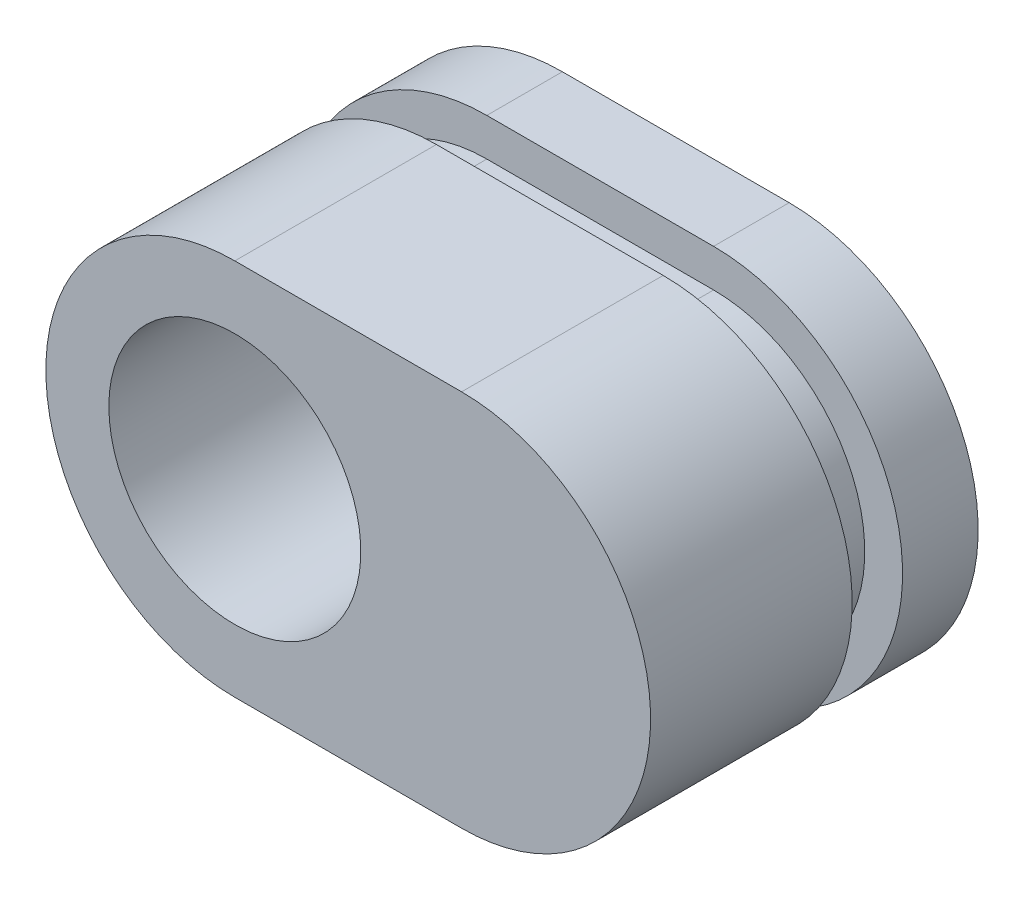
ISO-10303-21;
HEADER;
FILE_DESCRIPTION(('STEP AP214'),'2;1');
FILE_NAME('part.step','',(''),(''),'','','');
FILE_SCHEMA(('AUTOMOTIVE_DESIGN { 1 0 10303 214 1 1 1 1 }'));
ENDSEC;
DATA;
#1=APPLICATION_CONTEXT('core data for automotive mechanical design processes');
#2=APPLICATION_PROTOCOL_DEFINITION('international standard','automotive_design',2000,#1);
#3=PRODUCT_CONTEXT('',#1,'mechanical');
#4=PRODUCT('Part','Part','',(#3));
#5=PRODUCT_RELATED_PRODUCT_CATEGORY('part','',(#4));
#6=PRODUCT_DEFINITION_FORMATION('','',#4);
#7=PRODUCT_DEFINITION_CONTEXT('part definition',#1,'design');
#8=PRODUCT_DEFINITION('design','',#6,#7);
#9=PRODUCT_DEFINITION_SHAPE('','',#8);
#10=(LENGTH_UNIT() NAMED_UNIT(*) SI_UNIT(.MILLI.,.METRE.));
#11=(NAMED_UNIT(*) PLANE_ANGLE_UNIT() SI_UNIT($,.RADIAN.));
#12=(NAMED_UNIT(*) SI_UNIT($,.STERADIAN.) SOLID_ANGLE_UNIT());
#13=UNCERTAINTY_MEASURE_WITH_UNIT(LENGTH_MEASURE(1.E-05),#10,'distance_accuracy_value','');
#14=(GEOMETRIC_REPRESENTATION_CONTEXT(3) GLOBAL_UNCERTAINTY_ASSIGNED_CONTEXT((#13)) GLOBAL_UNIT_ASSIGNED_CONTEXT((#10,
#11,#12)) REPRESENTATION_CONTEXT('',''));
#15=CARTESIAN_POINT('',(0.,0.,0.));
#16=DIRECTION('',(0.,0.,1.));
#17=DIRECTION('',(1.,0.,0.));
#18=AXIS2_PLACEMENT_3D('',#15,#16,#17);
#19=CARTESIAN_POINT('',(4.5,0.,2.));
#20=DIRECTION('',(0.,0.,-1.));
#21=DIRECTION('',(-1.,0.,0.));
#22=AXIS2_PLACEMENT_3D('',#19,#20,#21);
#23=CYLINDRICAL_SURFACE('',#22,6.);
#24=CARTESIAN_POINT('',(4.5,0.,0.));
#25=DIRECTION('',(0.,0.,1.));
#26=DIRECTION('',(1.,0.,0.));
#27=AXIS2_PLACEMENT_3D('',#24,#25,#26);
#28=CIRCLE('',#27,6.);
#29=CARTESIAN_POINT('',(4.5,-6.,0.));
#30=VERTEX_POINT('',#29);
#31=CARTESIAN_POINT('',(4.5,6.,0.));
#32=VERTEX_POINT('',#31);
#33=EDGE_CURVE('E184',#30,#32,#28,.T.);
#34=ORIENTED_EDGE('',*,*,#33,.T.);
#35=DIRECTION('',(0.,0.,-1.));
#36=VECTOR('',#35,1.);
#37=CARTESIAN_POINT('',(4.5,6.,2.));
#38=LINE('',#37,#36);
#39=CARTESIAN_POINT('',(4.5,6.,2.));
#40=VERTEX_POINT('',#39);
#41=EDGE_CURVE('E11',#40,#32,#38,.T.);
#42=ORIENTED_EDGE('',*,*,#41,.F.);
#43=CARTESIAN_POINT('',(4.5,0.,2.));
#44=DIRECTION('',(0.,0.,1.));
#45=DIRECTION('',(1.,0.,0.));
#46=AXIS2_PLACEMENT_3D('',#43,#44,#45);
#47=CIRCLE('',#46,6.);
#48=CARTESIAN_POINT('',(4.5,-6.,2.));
#49=VERTEX_POINT('',#48);
#50=EDGE_CURVE('E185',#49,#40,#47,.T.);
#51=ORIENTED_EDGE('',*,*,#50,.F.);
#52=DIRECTION('',(0.,0.,-1.));
#53=VECTOR('',#52,1.);
#54=CARTESIAN_POINT('',(4.5,-6.,2.));
#55=LINE('',#54,#53);
#56=EDGE_CURVE('E198',#49,#30,#55,.T.);
#57=ORIENTED_EDGE('',*,*,#56,.T.);
#58=EDGE_LOOP('',(#34,#42,#51,#57));
#59=FACE_BOUND('',#58,.T.);
#60=ADVANCED_FACE('F39',(#59),#23,.T.);
#61=CARTESIAN_POINT('',(4.5,6.,2.));
#62=DIRECTION('',(0.,-1.,0.));
#63=DIRECTION('',(1.,0.,0.));
#64=AXIS2_PLACEMENT_3D('',#61,#62,#63);
#65=PLANE('',#64);
#66=DIRECTION('',(-1.,0.,0.));
#67=VECTOR('',#66,1.);
#68=CARTESIAN_POINT('',(4.5,6.,0.));
#69=LINE('',#68,#67);
#70=CARTESIAN_POINT('',(-4.5,6.,0.));
#71=VERTEX_POINT('',#70);
#72=EDGE_CURVE('E201',#32,#71,#69,.T.);
#73=ORIENTED_EDGE('',*,*,#72,.T.);
#74=DIRECTION('',(0.,0.,-1.));
#75=VECTOR('',#74,1.);
#76=CARTESIAN_POINT('',(-4.5,6.,2.));
#77=LINE('',#76,#75);
#78=CARTESIAN_POINT('',(-4.5,6.,2.));
#79=VERTEX_POINT('',#78);
#80=EDGE_CURVE('E47',#79,#71,#77,.T.);
#81=ORIENTED_EDGE('',*,*,#80,.F.);
#82=DIRECTION('',(-1.,0.,0.));
#83=VECTOR('',#82,1.);
#84=CARTESIAN_POINT('',(4.5,6.,2.));
#85=LINE('',#84,#83);
#86=EDGE_CURVE('E188',#40,#79,#85,.T.);
#87=ORIENTED_EDGE('',*,*,#86,.F.);
#88=ORIENTED_EDGE('',*,*,#41,.T.);
#89=EDGE_LOOP('',(#73,#81,#87,#88));
#90=FACE_BOUND('',#89,.T.);
#91=ADVANCED_FACE('F214',(#90),#65,.F.);
#92=CARTESIAN_POINT('',(-4.5,0.,2.));
#93=DIRECTION('',(0.,0.,-1.));
#94=DIRECTION('',(-1.,0.,0.));
#95=AXIS2_PLACEMENT_3D('',#92,#93,#94);
#96=CYLINDRICAL_SURFACE('',#95,6.);
#97=CARTESIAN_POINT('',(-4.5,0.,0.));
#98=DIRECTION('',(0.,0.,1.));
#99=DIRECTION('',(1.,0.,0.));
#100=AXIS2_PLACEMENT_3D('',#97,#98,#99);
#101=CIRCLE('',#100,6.);
#102=CARTESIAN_POINT('',(-4.5,-6.,0.));
#103=VERTEX_POINT('',#102);
#104=EDGE_CURVE('E204',#71,#103,#101,.T.);
#105=ORIENTED_EDGE('',*,*,#104,.T.);
#106=DIRECTION('',(0.,0.,-1.));
#107=VECTOR('',#106,1.);
#108=CARTESIAN_POINT('',(-4.5,-6.,2.));
#109=LINE('',#108,#107);
#110=CARTESIAN_POINT('',(-4.5,-6.,2.));
#111=VERTEX_POINT('',#110);
#112=EDGE_CURVE('E54',#111,#103,#109,.T.);
#113=ORIENTED_EDGE('',*,*,#112,.F.);
#114=CARTESIAN_POINT('',(-4.5,0.,2.));
#115=DIRECTION('',(0.,0.,1.));
#116=DIRECTION('',(1.,0.,0.));
#117=AXIS2_PLACEMENT_3D('',#114,#115,#116);
#118=CIRCLE('',#117,6.);
#119=EDGE_CURVE('E192',#79,#111,#118,.T.);
#120=ORIENTED_EDGE('',*,*,#119,.F.);
#121=ORIENTED_EDGE('',*,*,#80,.T.);
#122=EDGE_LOOP('',(#105,#113,#120,#121));
#123=FACE_BOUND('',#122,.T.);
#124=ADVANCED_FACE('F211',(#123),#96,.T.);
#125=CARTESIAN_POINT('',(4.5,-6.,2.));
#126=DIRECTION('',(0.,1.,0.));
#127=DIRECTION('',(-1.,0.,0.));
#128=AXIS2_PLACEMENT_3D('',#125,#126,#127);
#129=PLANE('',#128);
#130=DIRECTION('',(1.,0.,0.));
#131=VECTOR('',#130,1.);
#132=CARTESIAN_POINT('',(4.5,-6.,0.));
#133=LINE('',#132,#131);
#134=EDGE_CURVE('E189',#103,#30,#133,.T.);
#135=ORIENTED_EDGE('',*,*,#134,.T.);
#136=ORIENTED_EDGE('',*,*,#56,.F.);
#137=DIRECTION('',(1.,0.,0.));
#138=VECTOR('',#137,1.);
#139=CARTESIAN_POINT('',(4.5,-6.,2.));
#140=LINE('',#139,#138);
#141=EDGE_CURVE('E195',#111,#49,#140,.T.);
#142=ORIENTED_EDGE('',*,*,#141,.F.);
#143=ORIENTED_EDGE('',*,*,#112,.T.);
#144=EDGE_LOOP('',(#135,#136,#142,#143));
#145=FACE_BOUND('',#144,.T.);
#146=ADVANCED_FACE('F221',(#145),#129,.F.);
#147=CARTESIAN_POINT('',(-4.5,0.,2.));
#148=DIRECTION('',(0.,0.,1.));
#149=DIRECTION('',(1.,0.,0.));
#150=AXIS2_PLACEMENT_3D('',#147,#148,#149);
#151=PLANE('',#150);
#152=CARTESIAN_POINT('',(-4.5,0.,2.));
#153=DIRECTION('',(0.,0.,1.));
#154=DIRECTION('',(1.,0.,0.));
#155=AXIS2_PLACEMENT_3D('',#152,#153,#154);
#156=CIRCLE('',#155,7.5);
#157=CARTESIAN_POINT('',(-4.5,7.5,2.));
#158=VERTEX_POINT('',#157);
#159=CARTESIAN_POINT('',(-4.5,-7.5,2.));
#160=VERTEX_POINT('',#159);
#161=EDGE_CURVE('E149',#158,#160,#156,.T.);
#162=ORIENTED_EDGE('',*,*,#161,.F.);
#163=DIRECTION('',(-1.,0.,0.));
#164=VECTOR('',#163,1.);
#165=CARTESIAN_POINT('',(-4.5,7.5,2.));
#166=LINE('',#165,#164);
#167=CARTESIAN_POINT('',(4.5,7.5,2.));
#168=VERTEX_POINT('',#167);
#169=EDGE_CURVE('E162',#168,#158,#166,.T.);
#170=ORIENTED_EDGE('',*,*,#169,.F.);
#171=CARTESIAN_POINT('',(4.5,0.,2.));
#172=DIRECTION('',(0.,0.,1.));
#173=DIRECTION('',(1.,0.,0.));
#174=AXIS2_PLACEMENT_3D('',#171,#172,#173);
#175=CIRCLE('',#174,7.5);
#176=CARTESIAN_POINT('',(4.5,-7.5,2.));
#177=VERTEX_POINT('',#176);
#178=EDGE_CURVE('E170',#177,#168,#175,.T.);
#179=ORIENTED_EDGE('',*,*,#178,.F.);
#180=DIRECTION('',(1.,0.,0.));
#181=VECTOR('',#180,1.);
#182=CARTESIAN_POINT('',(-4.5,-7.5,2.));
#183=LINE('',#182,#181);
#184=EDGE_CURVE('E152',#160,#177,#183,.T.);
#185=ORIENTED_EDGE('',*,*,#184,.F.);
#186=EDGE_LOOP('',(#162,#170,#179,#185));
#187=FACE_BOUND('',#186,.T.);
#188=ORIENTED_EDGE('',*,*,#141,.T.);
#189=ORIENTED_EDGE('',*,*,#50,.T.);
#190=ORIENTED_EDGE('',*,*,#86,.T.);
#191=ORIENTED_EDGE('',*,*,#119,.T.);
#192=EDGE_LOOP('',(#188,#189,#190,#191));
#193=FACE_BOUND('',#192,.T.);
#194=ADVANCED_FACE('F224',(#187,#193),#151,.F.);
#195=CARTESIAN_POINT('',(-4.5,0.,10.));
#196=DIRECTION('',(0.,0.,-1.));
#197=DIRECTION('',(-1.,0.,0.));
#198=AXIS2_PLACEMENT_3D('',#195,#196,#197);
#199=CYLINDRICAL_SURFACE('',#198,7.5);
#200=ORIENTED_EDGE('',*,*,#161,.T.);
#201=DIRECTION('',(0.,0.,-1.));
#202=VECTOR('',#201,1.);
#203=CARTESIAN_POINT('',(-4.5,-7.5,10.));
#204=LINE('',#203,#202);
#205=CARTESIAN_POINT('',(-4.5,-7.5,10.));
#206=VERTEX_POINT('',#205);
#207=EDGE_CURVE('E181',#206,#160,#204,.T.);
#208=ORIENTED_EDGE('',*,*,#207,.F.);
#209=CARTESIAN_POINT('',(-4.5,0.,10.));
#210=DIRECTION('',(0.,0.,1.));
#211=DIRECTION('',(1.,0.,0.));
#212=AXIS2_PLACEMENT_3D('',#209,#210,#211);
#213=CIRCLE('',#212,7.5);
#214=CARTESIAN_POINT('',(-4.5,7.5,10.));
#215=VERTEX_POINT('',#214);
#216=EDGE_CURVE('E158',#215,#206,#213,.T.);
#217=ORIENTED_EDGE('',*,*,#216,.F.);
#218=DIRECTION('',(0.,0.,-1.));
#219=VECTOR('',#218,1.);
#220=CARTESIAN_POINT('',(-4.5,7.5,10.));
#221=LINE('',#220,#219);
#222=EDGE_CURVE('E167',#215,#158,#221,.T.);
#223=ORIENTED_EDGE('',*,*,#222,.T.);
#224=EDGE_LOOP('',(#200,#208,#217,#223));
#225=FACE_BOUND('',#224,.T.);
#226=ADVANCED_FACE('F226',(#225),#199,.T.);
#227=CARTESIAN_POINT('',(-4.5,-7.5,10.));
#228=DIRECTION('',(0.,1.,0.));
#229=DIRECTION('',(0.,0.,1.));
#230=AXIS2_PLACEMENT_3D('',#227,#228,#229);
#231=PLANE('',#230);
#232=ORIENTED_EDGE('',*,*,#184,.T.);
#233=DIRECTION('',(0.,0.,-1.));
#234=VECTOR('',#233,1.);
#235=CARTESIAN_POINT('',(4.5,-7.5,10.));
#236=LINE('',#235,#234);
#237=CARTESIAN_POINT('',(4.5,-7.5,10.));
#238=VERTEX_POINT('',#237);
#239=EDGE_CURVE('E178',#238,#177,#236,.T.);
#240=ORIENTED_EDGE('',*,*,#239,.F.);
#241=DIRECTION('',(1.,0.,0.));
#242=VECTOR('',#241,1.);
#243=CARTESIAN_POINT('',(-4.5,-7.5,10.));
#244=LINE('',#243,#242);
#245=EDGE_CURVE('E161',#206,#238,#244,.T.);
#246=ORIENTED_EDGE('',*,*,#245,.F.);
#247=ORIENTED_EDGE('',*,*,#207,.T.);
#248=EDGE_LOOP('',(#232,#240,#246,#247));
#249=FACE_BOUND('',#248,.T.);
#250=ADVANCED_FACE('F232',(#249),#231,.F.);
#251=CARTESIAN_POINT('',(4.5,0.,10.));
#252=DIRECTION('',(0.,0.,-1.));
#253=DIRECTION('',(-1.,0.,0.));
#254=AXIS2_PLACEMENT_3D('',#251,#252,#253);
#255=CYLINDRICAL_SURFACE('',#254,7.5);
#256=ORIENTED_EDGE('',*,*,#178,.T.);
#257=DIRECTION('',(0.,0.,-1.));
#258=VECTOR('',#257,1.);
#259=CARTESIAN_POINT('',(4.5,7.5,10.));
#260=LINE('',#259,#258);
#261=CARTESIAN_POINT('',(4.5,7.5,10.));
#262=VERTEX_POINT('',#261);
#263=EDGE_CURVE('E175',#262,#168,#260,.T.);
#264=ORIENTED_EDGE('',*,*,#263,.F.);
#265=CARTESIAN_POINT('',(4.5,0.,10.));
#266=DIRECTION('',(0.,0.,1.));
#267=DIRECTION('',(1.,0.,0.));
#268=AXIS2_PLACEMENT_3D('',#265,#266,#267);
#269=CIRCLE('',#268,7.5);
#270=EDGE_CURVE('E164',#238,#262,#269,.T.);
#271=ORIENTED_EDGE('',*,*,#270,.F.);
#272=ORIENTED_EDGE('',*,*,#239,.T.);
#273=EDGE_LOOP('',(#256,#264,#271,#272));
#274=FACE_BOUND('',#273,.T.);
#275=ADVANCED_FACE('F252',(#274),#255,.T.);
#276=CARTESIAN_POINT('',(-4.5,7.5,10.));
#277=DIRECTION('',(0.,-1.,0.));
#278=DIRECTION('',(0.,0.,-1.));
#279=AXIS2_PLACEMENT_3D('',#276,#277,#278);
#280=PLANE('',#279);
#281=ORIENTED_EDGE('',*,*,#169,.T.);
#282=ORIENTED_EDGE('',*,*,#222,.F.);
#283=DIRECTION('',(-1.,0.,0.));
#284=VECTOR('',#283,1.);
#285=CARTESIAN_POINT('',(-4.5,7.5,10.));
#286=LINE('',#285,#284);
#287=EDGE_CURVE('E166',#262,#215,#286,.T.);
#288=ORIENTED_EDGE('',*,*,#287,.F.);
#289=ORIENTED_EDGE('',*,*,#263,.T.);
#290=EDGE_LOOP('',(#281,#282,#288,#289));
#291=FACE_BOUND('',#290,.T.);
#292=ADVANCED_FACE('F255',(#291),#280,.F.);
#293=CARTESIAN_POINT('',(-4.5,0.,10.));
#294=DIRECTION('',(0.,0.,1.));
#295=DIRECTION('',(1.,0.,0.));
#296=AXIS2_PLACEMENT_3D('',#293,#294,#295);
#297=PLANE('',#296);
#298=CARTESIAN_POINT('',(-4.5,0.,10.));
#299=DIRECTION('',(0.,0.,-1.));
#300=DIRECTION('',(-1.,0.,0.));
#301=AXIS2_PLACEMENT_3D('',#298,#299,#300);
#302=CIRCLE('',#301,5.);
#303=CARTESIAN_POINT('',(-9.5,0.,10.));
#304=VERTEX_POINT('',#303);
#305=EDGE_CURVE('E301',#304,#304,#302,.T.);
#306=ORIENTED_EDGE('',*,*,#305,.T.);
#307=EDGE_LOOP('',(#306));
#308=FACE_BOUND('',#307,.T.);
#309=ORIENTED_EDGE('',*,*,#216,.T.);
#310=ORIENTED_EDGE('',*,*,#245,.T.);
#311=ORIENTED_EDGE('',*,*,#270,.T.);
#312=ORIENTED_EDGE('',*,*,#287,.T.);
#313=EDGE_LOOP('',(#309,#310,#311,#312));
#314=FACE_BOUND('',#313,.T.);
#315=ADVANCED_FACE('F257',(#308,#314),#297,.T.);
#316=CARTESIAN_POINT('',(4.5,0.,-3.));
#317=DIRECTION('',(0.,0.,1.));
#318=DIRECTION('',(1.,0.,0.));
#319=AXIS2_PLACEMENT_3D('',#316,#317,#318);
#320=CYLINDRICAL_SURFACE('',#319,7.5);
#321=CARTESIAN_POINT('',(4.5,0.,0.));
#322=DIRECTION('',(0.,0.,-1.));
#323=DIRECTION('',(-1.,0.,0.));
#324=AXIS2_PLACEMENT_3D('',#321,#322,#323);
#325=CIRCLE('',#324,7.5);
#326=CARTESIAN_POINT('',(4.5,7.5,0.));
#327=VERTEX_POINT('',#326);
#328=CARTESIAN_POINT('',(4.5,-7.5,0.));
#329=VERTEX_POINT('',#328);
#330=EDGE_CURVE('E148',#327,#329,#325,.T.);
#331=ORIENTED_EDGE('',*,*,#330,.T.);
#332=DIRECTION('',(0.,0.,1.));
#333=VECTOR('',#332,1.);
#334=CARTESIAN_POINT('',(4.5,-7.5,-3.));
#335=LINE('',#334,#333);
#336=CARTESIAN_POINT('',(4.5,-7.5,-3.));
#337=VERTEX_POINT('',#336);
#338=EDGE_CURVE('E128',#337,#329,#335,.T.);
#339=ORIENTED_EDGE('',*,*,#338,.F.);
#340=CARTESIAN_POINT('',(4.5,0.,-3.));
#341=DIRECTION('',(0.,0.,-1.));
#342=DIRECTION('',(-1.,0.,0.));
#343=AXIS2_PLACEMENT_3D('',#340,#341,#342);
#344=CIRCLE('',#343,7.5);
#345=CARTESIAN_POINT('',(4.5,7.5,-3.));
#346=VERTEX_POINT('',#345);
#347=EDGE_CURVE('E135',#346,#337,#344,.T.);
#348=ORIENTED_EDGE('',*,*,#347,.F.);
#349=DIRECTION('',(0.,0.,1.));
#350=VECTOR('',#349,1.);
#351=CARTESIAN_POINT('',(4.5,7.5,-3.));
#352=LINE('',#351,#350);
#353=EDGE_CURVE('E310',#346,#327,#352,.T.);
#354=ORIENTED_EDGE('',*,*,#353,.T.);
#355=EDGE_LOOP('',(#331,#339,#348,#354));
#356=FACE_BOUND('',#355,.T.);
#357=ADVANCED_FACE('F146',(#356),#320,.T.);
#358=CARTESIAN_POINT('',(4.5,-7.5,-3.));
#359=DIRECTION('',(0.,1.,0.));
#360=DIRECTION('',(0.,0.,1.));
#361=AXIS2_PLACEMENT_3D('',#358,#359,#360);
#362=PLANE('',#361);
#363=DIRECTION('',(-1.,0.,0.));
#364=VECTOR('',#363,1.);
#365=CARTESIAN_POINT('',(4.5,-7.5,0.));
#366=LINE('',#365,#364);
#367=CARTESIAN_POINT('',(-4.5,-7.5,0.));
#368=VERTEX_POINT('',#367);
#369=EDGE_CURVE('E312',#329,#368,#366,.T.);
#370=ORIENTED_EDGE('',*,*,#369,.T.);
#371=DIRECTION('',(0.,0.,1.));
#372=VECTOR('',#371,1.);
#373=CARTESIAN_POINT('',(-4.5,-7.5,-3.));
#374=LINE('',#373,#372);
#375=CARTESIAN_POINT('',(-4.5,-7.5,-3.));
#376=VERTEX_POINT('',#375);
#377=EDGE_CURVE('E131',#376,#368,#374,.T.);
#378=ORIENTED_EDGE('',*,*,#377,.F.);
#379=DIRECTION('',(-1.,0.,0.));
#380=VECTOR('',#379,1.);
#381=CARTESIAN_POINT('',(4.5,-7.5,-3.));
#382=LINE('',#381,#380);
#383=EDGE_CURVE('E124',#337,#376,#382,.T.);
#384=ORIENTED_EDGE('',*,*,#383,.F.);
#385=ORIENTED_EDGE('',*,*,#338,.T.);
#386=EDGE_LOOP('',(#370,#378,#384,#385));
#387=FACE_BOUND('',#386,.T.);
#388=ADVANCED_FACE('F126',(#387),#362,.F.);
#389=CARTESIAN_POINT('',(-4.5,0.,-3.));
#390=DIRECTION('',(0.,0.,1.));
#391=DIRECTION('',(1.,0.,0.));
#392=AXIS2_PLACEMENT_3D('',#389,#390,#391);
#393=CYLINDRICAL_SURFACE('',#392,7.5);
#394=CARTESIAN_POINT('',(-4.5,0.,0.));
#395=DIRECTION('',(0.,0.,-1.));
#396=DIRECTION('',(-1.,0.,0.));
#397=AXIS2_PLACEMENT_3D('',#394,#395,#396);
#398=CIRCLE('',#397,7.5);
#399=CARTESIAN_POINT('',(-4.5,7.5,0.));
#400=VERTEX_POINT('',#399);
#401=EDGE_CURVE('E314',#368,#400,#398,.T.);
#402=ORIENTED_EDGE('',*,*,#401,.T.);
#403=DIRECTION('',(0.,0.,1.));
#404=VECTOR('',#403,1.);
#405=CARTESIAN_POINT('',(-4.5,7.5,-3.));
#406=LINE('',#405,#404);
#407=CARTESIAN_POINT('',(-4.5,7.5,-3.));
#408=VERTEX_POINT('',#407);
#409=EDGE_CURVE('E154',#408,#400,#406,.T.);
#410=ORIENTED_EDGE('',*,*,#409,.F.);
#411=CARTESIAN_POINT('',(-4.5,0.,-3.));
#412=DIRECTION('',(0.,0.,-1.));
#413=DIRECTION('',(-1.,0.,0.));
#414=AXIS2_PLACEMENT_3D('',#411,#412,#413);
#415=CIRCLE('',#414,7.5);
#416=EDGE_CURVE('E134',#376,#408,#415,.T.);
#417=ORIENTED_EDGE('',*,*,#416,.F.);
#418=ORIENTED_EDGE('',*,*,#377,.T.);
#419=EDGE_LOOP('',(#402,#410,#417,#418));
#420=FACE_BOUND('',#419,.T.);
#421=ADVANCED_FACE('F283',(#420),#393,.T.);
#422=CARTESIAN_POINT('',(4.5,7.5,-3.));
#423=DIRECTION('',(0.,-1.,0.));
#424=DIRECTION('',(0.,0.,-1.));
#425=AXIS2_PLACEMENT_3D('',#422,#423,#424);
#426=PLANE('',#425);
#427=DIRECTION('',(1.,0.,0.));
#428=VECTOR('',#427,1.);
#429=CARTESIAN_POINT('',(4.5,7.5,0.));
#430=LINE('',#429,#428);
#431=EDGE_CURVE('E144',#400,#327,#430,.T.);
#432=ORIENTED_EDGE('',*,*,#431,.T.);
#433=ORIENTED_EDGE('',*,*,#353,.F.);
#434=DIRECTION('',(1.,0.,0.));
#435=VECTOR('',#434,1.);
#436=CARTESIAN_POINT('',(4.5,7.5,-3.));
#437=LINE('',#436,#435);
#438=EDGE_CURVE('E140',#408,#346,#437,.T.);
#439=ORIENTED_EDGE('',*,*,#438,.F.);
#440=ORIENTED_EDGE('',*,*,#409,.T.);
#441=EDGE_LOOP('',(#432,#433,#439,#440));
#442=FACE_BOUND('',#441,.T.);
#443=ADVANCED_FACE('F286',(#442),#426,.F.);
#444=CARTESIAN_POINT('',(4.5,0.,-3.));
#445=DIRECTION('',(0.,0.,-1.));
#446=DIRECTION('',(-1.,0.,0.));
#447=AXIS2_PLACEMENT_3D('',#444,#445,#446);
#448=PLANE('',#447);
#449=CARTESIAN_POINT('',(-4.5,0.,-3.));
#450=DIRECTION('',(0.,0.,-1.));
#451=DIRECTION('',(-1.,0.,0.));
#452=AXIS2_PLACEMENT_3D('',#449,#450,#451);
#453=CIRCLE('',#452,5.);
#454=CARTESIAN_POINT('',(-9.5,0.,-3.));
#455=VERTEX_POINT('',#454);
#456=EDGE_CURVE('E304',#455,#455,#453,.T.);
#457=ORIENTED_EDGE('',*,*,#456,.F.);
#458=EDGE_LOOP('',(#457));
#459=FACE_BOUND('',#458,.T.);
#460=ORIENTED_EDGE('',*,*,#347,.T.);
#461=ORIENTED_EDGE('',*,*,#383,.T.);
#462=ORIENTED_EDGE('',*,*,#416,.T.);
#463=ORIENTED_EDGE('',*,*,#438,.T.);
#464=EDGE_LOOP('',(#460,#461,#462,#463));
#465=FACE_BOUND('',#464,.T.);
#466=ADVANCED_FACE('F138',(#459,#465),#448,.T.);
#467=CARTESIAN_POINT('',(4.5,0.,0.));
#468=DIRECTION('',(0.,0.,-1.));
#469=DIRECTION('',(-1.,0.,0.));
#470=AXIS2_PLACEMENT_3D('',#467,#468,#469);
#471=PLANE('',#470);
#472=ORIENTED_EDGE('',*,*,#33,.F.);
#473=ORIENTED_EDGE('',*,*,#134,.F.);
#474=ORIENTED_EDGE('',*,*,#104,.F.);
#475=ORIENTED_EDGE('',*,*,#72,.F.);
#476=EDGE_LOOP('',(#472,#473,#474,#475));
#477=FACE_BOUND('',#476,.T.);
#478=ORIENTED_EDGE('',*,*,#330,.F.);
#479=ORIENTED_EDGE('',*,*,#431,.F.);
#480=ORIENTED_EDGE('',*,*,#401,.F.);
#481=ORIENTED_EDGE('',*,*,#369,.F.);
#482=EDGE_LOOP('',(#478,#479,#480,#481));
#483=FACE_BOUND('',#482,.T.);
#484=ADVANCED_FACE('F217',(#477,#483),#471,.F.);
#485=CARTESIAN_POINT('',(-4.5,0.,10.));
#486=DIRECTION('',(0.,0.,-1.));
#487=DIRECTION('',(-1.,0.,0.));
#488=AXIS2_PLACEMENT_3D('',#485,#486,#487);
#489=CYLINDRICAL_SURFACE('',#488,5.);
#490=CARTESIAN_POINT('',(-9.5,0.,10.));
#491=CARTESIAN_POINT('',(-9.5,0.,9.86458333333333));
#492=CARTESIAN_POINT('',(-9.5,0.,9.72916666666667));
#493=CARTESIAN_POINT('',(-9.5,0.,9.45833333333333));
#494=CARTESIAN_POINT('',(-9.5,0.,9.32291666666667));
#495=CARTESIAN_POINT('',(-9.5,0.,9.05208333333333));
#496=CARTESIAN_POINT('',(-9.5,0.,8.91666666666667));
#497=CARTESIAN_POINT('',(-9.5,0.,8.64583333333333));
#498=CARTESIAN_POINT('',(-9.5,0.,8.51041666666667));
#499=CARTESIAN_POINT('',(-9.5,0.,8.23958333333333));
#500=CARTESIAN_POINT('',(-9.5,0.,8.10416666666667));
#501=CARTESIAN_POINT('',(-9.5,0.,7.83333333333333));
#502=CARTESIAN_POINT('',(-9.5,0.,7.69791666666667));
#503=CARTESIAN_POINT('',(-9.5,0.,7.42708333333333));
#504=CARTESIAN_POINT('',(-9.5,0.,7.29166666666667));
#505=CARTESIAN_POINT('',(-9.5,0.,7.02083333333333));
#506=CARTESIAN_POINT('',(-9.5,0.,6.88541666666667));
#507=CARTESIAN_POINT('',(-9.5,0.,6.61458333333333));
#508=CARTESIAN_POINT('',(-9.5,0.,6.47916666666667));
#509=CARTESIAN_POINT('',(-9.5,0.,6.20833333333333));
#510=CARTESIAN_POINT('',(-9.5,0.,6.07291666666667));
#511=CARTESIAN_POINT('',(-9.5,0.,5.80208333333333));
#512=CARTESIAN_POINT('',(-9.5,0.,5.66666666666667));
#513=CARTESIAN_POINT('',(-9.5,0.,5.39583333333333));
#514=CARTESIAN_POINT('',(-9.5,0.,5.26041666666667));
#515=CARTESIAN_POINT('',(-9.5,0.,4.98958333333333));
#516=CARTESIAN_POINT('',(-9.5,0.,4.85416666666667));
#517=CARTESIAN_POINT('',(-9.5,0.,4.58333333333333));
#518=CARTESIAN_POINT('',(-9.5,0.,4.44791666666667));
#519=CARTESIAN_POINT('',(-9.5,0.,4.17708333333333));
#520=CARTESIAN_POINT('',(-9.5,0.,4.04166666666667));
#521=CARTESIAN_POINT('',(-9.5,0.,3.77083333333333));
#522=CARTESIAN_POINT('',(-9.5,0.,3.63541666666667));
#523=CARTESIAN_POINT('',(-9.5,0.,3.36458333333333));
#524=CARTESIAN_POINT('',(-9.5,0.,3.22916666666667));
#525=CARTESIAN_POINT('',(-9.5,0.,2.95833333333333));
#526=CARTESIAN_POINT('',(-9.5,0.,2.82291666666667));
#527=CARTESIAN_POINT('',(-9.5,0.,2.55208333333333));
#528=CARTESIAN_POINT('',(-9.5,0.,2.41666666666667));
#529=CARTESIAN_POINT('',(-9.5,0.,2.14583333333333));
#530=CARTESIAN_POINT('',(-9.5,0.,2.01041666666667));
#531=CARTESIAN_POINT('',(-9.5,0.,1.73958333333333));
#532=CARTESIAN_POINT('',(-9.5,0.,1.60416666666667));
#533=CARTESIAN_POINT('',(-9.5,0.,1.33333333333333));
#534=CARTESIAN_POINT('',(-9.5,0.,1.19791666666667));
#535=CARTESIAN_POINT('',(-9.5,0.,0.927083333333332));
#536=CARTESIAN_POINT('',(-9.5,0.,0.791666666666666));
#537=CARTESIAN_POINT('',(-9.5,0.,0.520833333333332));
#538=CARTESIAN_POINT('',(-9.5,0.,0.385416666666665));
#539=CARTESIAN_POINT('',(-9.5,0.,0.114583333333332));
#540=CARTESIAN_POINT('',(-9.5,0.,-0.0208333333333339));
#541=CARTESIAN_POINT('',(-9.5,0.,-0.291666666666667));
#542=CARTESIAN_POINT('',(-9.5,0.,-0.427083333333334));
#543=CARTESIAN_POINT('',(-9.5,0.,-0.697916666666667));
#544=CARTESIAN_POINT('',(-9.5,0.,-0.833333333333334));
#545=CARTESIAN_POINT('',(-9.5,0.,-1.10416666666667));
#546=CARTESIAN_POINT('',(-9.5,0.,-1.23958333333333));
#547=CARTESIAN_POINT('',(-9.5,0.,-1.51041666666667));
#548=CARTESIAN_POINT('',(-9.5,0.,-1.64583333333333));
#549=CARTESIAN_POINT('',(-9.5,0.,-1.91666666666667));
#550=CARTESIAN_POINT('',(-9.5,0.,-2.05208333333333));
#551=CARTESIAN_POINT('',(-9.5,0.,-2.32291666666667));
#552=CARTESIAN_POINT('',(-9.5,0.,-2.45833333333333));
#553=CARTESIAN_POINT('',(-9.5,0.,-2.72916666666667));
#554=CARTESIAN_POINT('',(-9.5,0.,-2.86458333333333));
#555=CARTESIAN_POINT('',(-9.5,0.,-3.));
#556=B_SPLINE_CURVE_WITH_KNOTS('',3,(#490,#491,#492,#493,#494,#495,#496,#497,#498,#499,#500,
#501,#502,#503,#504,#505,#506,#507,#508,#509,#510,#511,#512,#513,#514,#515,#516,#517,#518,#519,
#520,#521,#522,#523,#524,#525,#526,#527,#528,#529,#530,#531,#532,#533,#534,#535,#536,#537,#538,
#539,#540,#541,#542,#543,#544,#545,#546,#547,#548,#549,#550,#551,#552,#553,#554,#555),
.UNSPECIFIED.,.F.,.F.,(4,2,2,2,2,2,2,2,2,2,2,2,2,2,2,2,2,2,2,2,2,2,2,2,2,2,2,2,2,2,2,2,4),(0.,
0.406249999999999,0.812499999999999,1.21875,1.625,2.03125,2.4375,2.84375,3.25,3.65625,4.0625,
4.46875,4.875,5.28125,5.6875,6.09375,6.5,6.90625,7.3125,7.71875,8.125,8.53125,8.9375,9.34375,
9.75,10.15625,10.5625,10.96875,11.375,11.78125,12.1875,12.59375,13.),.UNSPECIFIED.);
#557=EDGE_CURVE('BSEAM292',#304,#455,#556,.T.);
#558=ORIENTED_EDGE('',*,*,#305,.F.);
#559=ORIENTED_EDGE('',*,*,#456,.T.);
#560=ORIENTED_EDGE('',*,*,#557,.T.);
#561=ORIENTED_EDGE('',*,*,#557,.F.);
#562=EDGE_LOOP('',(#558,#560,#559,#561));
#563=FACE_BOUND('',#562,.T.);
#564=ADVANCED_FACE('F292',(#563),#489,.F.);
#565=CLOSED_SHELL('',(#60,#91,#124,#146,#194,#226,#250,#275,#292,#315,#357,#388,#421,#443,#466,
#484,#564));
#566=MANIFOLD_SOLID_BREP('B2',#565);
#567=ADVANCED_BREP_SHAPE_REPRESENTATION('',(#18,#566),#14);
#568=SHAPE_DEFINITION_REPRESENTATION(#9,#567);
ENDSEC;
END-ISO-10303-21;
